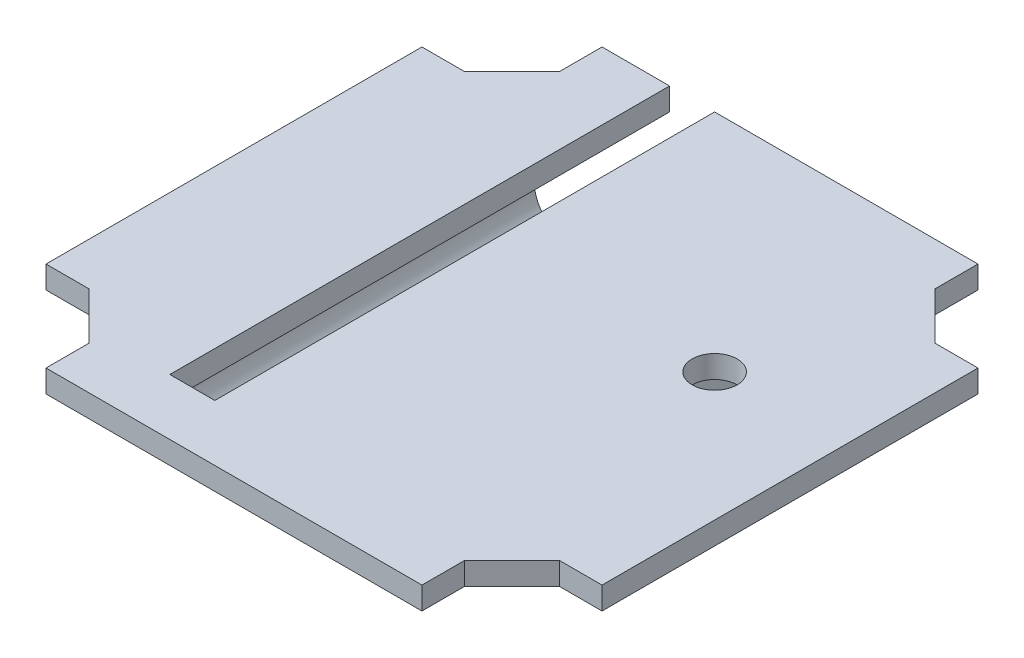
ISO-10303-21;
HEADER;
FILE_DESCRIPTION(('STEP AP214'),'2;1');
FILE_NAME('part.step','',(''),(''),'','','');
FILE_SCHEMA(('AUTOMOTIVE_DESIGN { 1 0 10303 214 1 1 1 1 }'));
ENDSEC;
DATA;
#1=APPLICATION_CONTEXT('core data for automotive mechanical design processes');
#2=APPLICATION_PROTOCOL_DEFINITION('international standard','automotive_design',2000,#1);
#3=PRODUCT_CONTEXT('',#1,'mechanical');
#4=PRODUCT('Part','Part','',(#3));
#5=PRODUCT_RELATED_PRODUCT_CATEGORY('part','',(#4));
#6=PRODUCT_DEFINITION_FORMATION('','',#4);
#7=PRODUCT_DEFINITION_CONTEXT('part definition',#1,'design');
#8=PRODUCT_DEFINITION('design','',#6,#7);
#9=PRODUCT_DEFINITION_SHAPE('','',#8);
#10=(LENGTH_UNIT() NAMED_UNIT(*) SI_UNIT(.MILLI.,.METRE.));
#11=(NAMED_UNIT(*) PLANE_ANGLE_UNIT() SI_UNIT($,.RADIAN.));
#12=(NAMED_UNIT(*) SI_UNIT($,.STERADIAN.) SOLID_ANGLE_UNIT());
#13=UNCERTAINTY_MEASURE_WITH_UNIT(LENGTH_MEASURE(1.E-05),#10,'distance_accuracy_value','');
#14=(GEOMETRIC_REPRESENTATION_CONTEXT(3) GLOBAL_UNCERTAINTY_ASSIGNED_CONTEXT((#13)) GLOBAL_UNIT_ASSIGNED_CONTEXT((#10,
#11,#12)) REPRESENTATION_CONTEXT('',''));
#15=CARTESIAN_POINT('',(0.,0.,0.));
#16=DIRECTION('',(0.,0.,1.));
#17=DIRECTION('',(1.,0.,0.));
#18=AXIS2_PLACEMENT_3D('',#15,#16,#17);
#19=CARTESIAN_POINT('',(0.,2.,-24.7));
#20=DIRECTION('',(0.,0.,-1.));
#21=DIRECTION('',(-1.,0.,0.));
#22=AXIS2_PLACEMENT_3D('',#19,#20,#21);
#23=PLANE('',#22);
#24=DIRECTION('',(0.,1.,0.));
#25=VECTOR('',#24,1.);
#26=CARTESIAN_POINT('',(-10.7,-6.,-24.7));
#27=LINE('',#26,#25);
#28=CARTESIAN_POINT('',(-10.7,0.,-24.7));
#29=VERTEX_POINT('',#28);
#30=CARTESIAN_POINT('',(-10.7,2.,-24.7));
#31=VERTEX_POINT('',#30);
#32=EDGE_CURVE('E262',#29,#31,#27,.T.);
#33=ORIENTED_EDGE('',*,*,#32,.F.);
#34=DIRECTION('',(1.,0.,0.));
#35=VECTOR('',#34,1.);
#36=CARTESIAN_POINT('',(0.,0.,-24.7));
#37=LINE('',#36,#35);
#38=CARTESIAN_POINT('',(-16.7,0.,-24.7));
#39=VERTEX_POINT('',#38);
#40=EDGE_CURVE('E428',#39,#29,#37,.T.);
#41=ORIENTED_EDGE('',*,*,#40,.F.);
#42=DIRECTION('',(0.,-1.,0.));
#43=VECTOR('',#42,1.);
#44=CARTESIAN_POINT('',(-16.7,2.,-24.7));
#45=LINE('',#44,#43);
#46=CARTESIAN_POINT('',(-16.7,2.,-24.7));
#47=VERTEX_POINT('',#46);
#48=EDGE_CURVE('E493',#47,#39,#45,.T.);
#49=ORIENTED_EDGE('',*,*,#48,.F.);
#50=DIRECTION('',(1.,0.,0.));
#51=VECTOR('',#50,1.);
#52=CARTESIAN_POINT('',(0.,2.,-24.7));
#53=LINE('',#52,#51);
#54=EDGE_CURVE('E375',#47,#31,#53,.T.);
#55=ORIENTED_EDGE('',*,*,#54,.T.);
#56=EDGE_LOOP('',(#33,#41,#49,#55));
#57=FACE_BOUND('',#56,.T.);
#58=ADVANCED_FACE('F43',(#57),#23,.T.);
#59=CARTESIAN_POINT('',(18.8,2.,18.8));
#60=DIRECTION('',(-0.707106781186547,0.,-0.707106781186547));
#61=DIRECTION('',(-0.707106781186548,0.,0.707106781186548));
#62=AXIS2_PLACEMENT_3D('',#59,#60,#61);
#63=PLANE('',#62);
#64=DIRECTION('',(0.707106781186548,0.,-0.707106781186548));
#65=VECTOR('',#64,1.);
#66=CARTESIAN_POINT('',(18.8,0.,18.8));
#67=LINE('',#66,#65);
#68=CARTESIAN_POINT('',(16.7,0.,20.9));
#69=VERTEX_POINT('',#68);
#70=CARTESIAN_POINT('',(20.9,0.,16.7));
#71=VERTEX_POINT('',#70);
#72=EDGE_CURVE('E342',#69,#71,#67,.T.);
#73=ORIENTED_EDGE('',*,*,#72,.T.);
#74=DIRECTION('',(0.,-1.,0.));
#75=VECTOR('',#74,1.);
#76=CARTESIAN_POINT('',(20.9,2.,16.7));
#77=LINE('',#76,#75);
#78=CARTESIAN_POINT('',(20.9,2.,16.7));
#79=VERTEX_POINT('',#78);
#80=EDGE_CURVE('E516',#79,#71,#77,.T.);
#81=ORIENTED_EDGE('',*,*,#80,.F.);
#82=DIRECTION('',(0.707106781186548,0.,-0.707106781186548));
#83=VECTOR('',#82,1.);
#84=CARTESIAN_POINT('',(18.8,2.,18.8));
#85=LINE('',#84,#83);
#86=CARTESIAN_POINT('',(16.7,2.,20.9));
#87=VERTEX_POINT('',#86);
#88=EDGE_CURVE('E355',#87,#79,#85,.T.);
#89=ORIENTED_EDGE('',*,*,#88,.F.);
#90=DIRECTION('',(0.,-1.,0.));
#91=VECTOR('',#90,1.);
#92=CARTESIAN_POINT('',(16.7,2.,20.9));
#93=LINE('',#92,#91);
#94=EDGE_CURVE('E407',#87,#69,#93,.T.);
#95=ORIENTED_EDGE('',*,*,#94,.T.);
#96=EDGE_LOOP('',(#73,#81,#89,#95));
#97=FACE_BOUND('',#96,.T.);
#98=ADVANCED_FACE('F614',(#97),#63,.F.);
#99=CARTESIAN_POINT('',(0.,2.,16.6999999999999));
#100=DIRECTION('',(0.,0.,-1.));
#101=DIRECTION('',(-1.,0.,0.));
#102=AXIS2_PLACEMENT_3D('',#99,#100,#101);
#103=PLANE('',#102);
#104=DIRECTION('',(1.,0.,0.));
#105=VECTOR('',#104,1.);
#106=CARTESIAN_POINT('',(0.,0.,16.6999999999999));
#107=LINE('',#106,#105);
#108=CARTESIAN_POINT('',(24.7,0.,16.7));
#109=VERTEX_POINT('',#108);
#110=EDGE_CURVE('E411',#71,#109,#107,.T.);
#111=ORIENTED_EDGE('',*,*,#110,.T.);
#112=DIRECTION('',(0.,-1.,0.));
#113=VECTOR('',#112,1.);
#114=CARTESIAN_POINT('',(24.7,2.,16.7));
#115=LINE('',#114,#113);
#116=CARTESIAN_POINT('',(24.7,2.,16.7));
#117=VERTEX_POINT('',#116);
#118=EDGE_CURVE('E512',#117,#109,#115,.T.);
#119=ORIENTED_EDGE('',*,*,#118,.F.);
#120=DIRECTION('',(1.,0.,0.));
#121=VECTOR('',#120,1.);
#122=CARTESIAN_POINT('',(0.,2.,16.6999999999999));
#123=LINE('',#122,#121);
#124=EDGE_CURVE('E359',#79,#117,#123,.T.);
#125=ORIENTED_EDGE('',*,*,#124,.F.);
#126=ORIENTED_EDGE('',*,*,#80,.T.);
#127=EDGE_LOOP('',(#111,#119,#125,#126));
#128=FACE_BOUND('',#127,.T.);
#129=ADVANCED_FACE('F611',(#128),#103,.F.);
#130=CARTESIAN_POINT('',(24.7,2.,0.));
#131=DIRECTION('',(-1.,0.,0.));
#132=DIRECTION('',(0.,0.,1.));
#133=AXIS2_PLACEMENT_3D('',#130,#131,#132);
#134=PLANE('',#133);
#135=DIRECTION('',(0.,0.,-1.));
#136=VECTOR('',#135,1.);
#137=CARTESIAN_POINT('',(24.7,0.,0.));
#138=LINE('',#137,#136);
#139=CARTESIAN_POINT('',(24.7,0.,-16.7));
#140=VERTEX_POINT('',#139);
#141=EDGE_CURVE('E414',#109,#140,#138,.T.);
#142=ORIENTED_EDGE('',*,*,#141,.T.);
#143=DIRECTION('',(0.,-1.,0.));
#144=VECTOR('',#143,1.);
#145=CARTESIAN_POINT('',(24.7,2.,-16.7));
#146=LINE('',#145,#144);
#147=CARTESIAN_POINT('',(24.7,2.,-16.7));
#148=VERTEX_POINT('',#147);
#149=EDGE_CURVE('E508',#148,#140,#146,.T.);
#150=ORIENTED_EDGE('',*,*,#149,.F.);
#151=DIRECTION('',(0.,0.,-1.));
#152=VECTOR('',#151,1.);
#153=CARTESIAN_POINT('',(24.7,2.,0.));
#154=LINE('',#153,#152);
#155=EDGE_CURVE('E363',#117,#148,#154,.T.);
#156=ORIENTED_EDGE('',*,*,#155,.F.);
#157=ORIENTED_EDGE('',*,*,#118,.T.);
#158=EDGE_LOOP('',(#142,#150,#156,#157));
#159=FACE_BOUND('',#158,.T.);
#160=ADVANCED_FACE('F605',(#159),#134,.F.);
#161=CARTESIAN_POINT('',(0.,2.,-16.7));
#162=DIRECTION('',(0.,0.,1.));
#163=DIRECTION('',(1.,0.,0.));
#164=AXIS2_PLACEMENT_3D('',#161,#162,#163);
#165=PLANE('',#164);
#166=DIRECTION('',(-1.,0.,0.));
#167=VECTOR('',#166,1.);
#168=CARTESIAN_POINT('',(0.,0.,-16.7));
#169=LINE('',#168,#167);
#170=CARTESIAN_POINT('',(20.9,0.,-16.7));
#171=VERTEX_POINT('',#170);
#172=EDGE_CURVE('E417',#140,#171,#169,.T.);
#173=ORIENTED_EDGE('',*,*,#172,.T.);
#174=DIRECTION('',(0.,-1.,0.));
#175=VECTOR('',#174,1.);
#176=CARTESIAN_POINT('',(20.9,2.,-16.7));
#177=LINE('',#176,#175);
#178=CARTESIAN_POINT('',(20.9,2.,-16.7));
#179=VERTEX_POINT('',#178);
#180=EDGE_CURVE('E504',#179,#171,#177,.T.);
#181=ORIENTED_EDGE('',*,*,#180,.F.);
#182=DIRECTION('',(-1.,0.,0.));
#183=VECTOR('',#182,1.);
#184=CARTESIAN_POINT('',(0.,2.,-16.7));
#185=LINE('',#184,#183);
#186=EDGE_CURVE('E366',#148,#179,#185,.T.);
#187=ORIENTED_EDGE('',*,*,#186,.F.);
#188=ORIENTED_EDGE('',*,*,#149,.T.);
#189=EDGE_LOOP('',(#173,#181,#187,#188));
#190=FACE_BOUND('',#189,.T.);
#191=ADVANCED_FACE('F601',(#190),#165,.F.);
#192=CARTESIAN_POINT('',(18.8,2.,-18.8));
#193=DIRECTION('',(-0.707106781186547,0.,0.707106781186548));
#194=DIRECTION('',(0.707106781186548,0.,0.707106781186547));
#195=AXIS2_PLACEMENT_3D('',#192,#193,#194);
#196=PLANE('',#195);
#197=DIRECTION('',(-0.707106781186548,0.,-0.707106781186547));
#198=VECTOR('',#197,1.);
#199=CARTESIAN_POINT('',(18.8,0.,-18.8));
#200=LINE('',#199,#198);
#201=CARTESIAN_POINT('',(16.7,0.,-20.9));
#202=VERTEX_POINT('',#201);
#203=EDGE_CURVE('E420',#171,#202,#200,.T.);
#204=ORIENTED_EDGE('',*,*,#203,.T.);
#205=DIRECTION('',(0.,-1.,0.));
#206=VECTOR('',#205,1.);
#207=CARTESIAN_POINT('',(16.7,2.,-20.9));
#208=LINE('',#207,#206);
#209=CARTESIAN_POINT('',(16.7,2.,-20.9));
#210=VERTEX_POINT('',#209);
#211=EDGE_CURVE('E500',#210,#202,#208,.T.);
#212=ORIENTED_EDGE('',*,*,#211,.F.);
#213=DIRECTION('',(-0.707106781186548,0.,-0.707106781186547));
#214=VECTOR('',#213,1.);
#215=CARTESIAN_POINT('',(18.8,2.,-18.8));
#216=LINE('',#215,#214);
#217=EDGE_CURVE('E369',#179,#210,#216,.T.);
#218=ORIENTED_EDGE('',*,*,#217,.F.);
#219=ORIENTED_EDGE('',*,*,#180,.T.);
#220=EDGE_LOOP('',(#204,#212,#218,#219));
#221=FACE_BOUND('',#220,.T.);
#222=ADVANCED_FACE('F597',(#221),#196,.F.);
#223=CARTESIAN_POINT('',(16.7,2.,0.));
#224=DIRECTION('',(-1.,0.,0.));
#225=DIRECTION('',(0.,0.,1.));
#226=AXIS2_PLACEMENT_3D('',#223,#224,#225);
#227=PLANE('',#226);
#228=DIRECTION('',(0.,0.,-1.));
#229=VECTOR('',#228,1.);
#230=CARTESIAN_POINT('',(16.7,0.,0.));
#231=LINE('',#230,#229);
#232=CARTESIAN_POINT('',(16.7,0.,-24.7));
#233=VERTEX_POINT('',#232);
#234=EDGE_CURVE('E423',#202,#233,#231,.T.);
#235=ORIENTED_EDGE('',*,*,#234,.T.);
#236=DIRECTION('',(0.,-1.,0.));
#237=VECTOR('',#236,1.);
#238=CARTESIAN_POINT('',(16.7,2.,-24.7));
#239=LINE('',#238,#237);
#240=CARTESIAN_POINT('',(16.7,2.,-24.7));
#241=VERTEX_POINT('',#240);
#242=EDGE_CURVE('E496',#241,#233,#239,.T.);
#243=ORIENTED_EDGE('',*,*,#242,.F.);
#244=DIRECTION('',(0.,0.,-1.));
#245=VECTOR('',#244,1.);
#246=CARTESIAN_POINT('',(16.7,2.,0.));
#247=LINE('',#246,#245);
#248=EDGE_CURVE('E372',#210,#241,#247,.T.);
#249=ORIENTED_EDGE('',*,*,#248,.F.);
#250=ORIENTED_EDGE('',*,*,#211,.T.);
#251=EDGE_LOOP('',(#235,#243,#249,#250));
#252=FACE_BOUND('',#251,.T.);
#253=ADVANCED_FACE('F592',(#252),#227,.F.);
#254=DIRECTION('',(0.,1.,0.));
#255=VECTOR('',#254,1.);
#256=CARTESIAN_POINT('',(-6.69999999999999,-6.,-24.7));
#257=LINE('',#256,#255);
#258=CARTESIAN_POINT('',(-6.69999999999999,0.,-24.7));
#259=VERTEX_POINT('',#258);
#260=CARTESIAN_POINT('',(-6.69999999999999,2.,-24.7));
#261=VERTEX_POINT('',#260);
#262=EDGE_CURVE('E270',#259,#261,#257,.T.);
#263=ORIENTED_EDGE('',*,*,#262,.T.);
#264=EDGE_CURVE('E275',#261,#241,#53,.T.);
#265=ORIENTED_EDGE('',*,*,#264,.T.);
#266=ORIENTED_EDGE('',*,*,#242,.T.);
#267=EDGE_CURVE('E427',#259,#233,#37,.T.);
#268=ORIENTED_EDGE('',*,*,#267,.F.);
#269=EDGE_LOOP('',(#263,#265,#266,#268));
#270=FACE_BOUND('',#269,.T.);
#271=ADVANCED_FACE('F584',(#270),#23,.T.);
#272=CARTESIAN_POINT('',(-16.7,2.,0.));
#273=DIRECTION('',(1.,0.,0.));
#274=DIRECTION('',(0.,0.,-1.));
#275=AXIS2_PLACEMENT_3D('',#272,#273,#274);
#276=PLANE('',#275);
#277=DIRECTION('',(0.,0.,1.));
#278=VECTOR('',#277,1.);
#279=CARTESIAN_POINT('',(-16.7,0.,0.));
#280=LINE('',#279,#278);
#281=CARTESIAN_POINT('',(-16.7,0.,-20.9));
#282=VERTEX_POINT('',#281);
#283=EDGE_CURVE('E432',#39,#282,#280,.T.);
#284=ORIENTED_EDGE('',*,*,#283,.T.);
#285=DIRECTION('',(0.,-1.,0.));
#286=VECTOR('',#285,1.);
#287=CARTESIAN_POINT('',(-16.7,2.,-20.9));
#288=LINE('',#287,#286);
#289=CARTESIAN_POINT('',(-16.7,2.,-20.9));
#290=VERTEX_POINT('',#289);
#291=EDGE_CURVE('E489',#290,#282,#288,.T.);
#292=ORIENTED_EDGE('',*,*,#291,.F.);
#293=DIRECTION('',(0.,0.,1.));
#294=VECTOR('',#293,1.);
#295=CARTESIAN_POINT('',(-16.7,2.,0.));
#296=LINE('',#295,#294);
#297=EDGE_CURVE('E379',#47,#290,#296,.T.);
#298=ORIENTED_EDGE('',*,*,#297,.F.);
#299=ORIENTED_EDGE('',*,*,#48,.T.);
#300=EDGE_LOOP('',(#284,#292,#298,#299));
#301=FACE_BOUND('',#300,.T.);
#302=ADVANCED_FACE('F657',(#301),#276,.F.);
#303=CARTESIAN_POINT('',(-18.8,2.,-18.8));
#304=DIRECTION('',(0.707106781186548,0.,0.707106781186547));
#305=DIRECTION('',(0.707106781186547,0.,-0.707106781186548));
#306=AXIS2_PLACEMENT_3D('',#303,#304,#305);
#307=PLANE('',#306);
#308=DIRECTION('',(-0.707106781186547,0.,0.707106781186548));
#309=VECTOR('',#308,1.);
#310=CARTESIAN_POINT('',(-18.8,0.,-18.8));
#311=LINE('',#310,#309);
#312=CARTESIAN_POINT('',(-20.9,0.,-16.7));
#313=VERTEX_POINT('',#312);
#314=EDGE_CURVE('E435',#282,#313,#311,.T.);
#315=ORIENTED_EDGE('',*,*,#314,.T.);
#316=DIRECTION('',(0.,-1.,0.));
#317=VECTOR('',#316,1.);
#318=CARTESIAN_POINT('',(-20.9,2.,-16.7));
#319=LINE('',#318,#317);
#320=CARTESIAN_POINT('',(-20.9,2.,-16.7));
#321=VERTEX_POINT('',#320);
#322=EDGE_CURVE('E485',#321,#313,#319,.T.);
#323=ORIENTED_EDGE('',*,*,#322,.F.);
#324=DIRECTION('',(-0.707106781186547,0.,0.707106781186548));
#325=VECTOR('',#324,1.);
#326=CARTESIAN_POINT('',(-18.8,2.,-18.8));
#327=LINE('',#326,#325);
#328=EDGE_CURVE('E382',#290,#321,#327,.T.);
#329=ORIENTED_EDGE('',*,*,#328,.F.);
#330=ORIENTED_EDGE('',*,*,#291,.T.);
#331=EDGE_LOOP('',(#315,#323,#329,#330));
#332=FACE_BOUND('',#331,.T.);
#333=ADVANCED_FACE('F652',(#332),#307,.F.);
#334=CARTESIAN_POINT('',(0.,2.,-16.7));
#335=DIRECTION('',(0.,0.,1.));
#336=DIRECTION('',(1.,0.,0.));
#337=AXIS2_PLACEMENT_3D('',#334,#335,#336);
#338=PLANE('',#337);
#339=DIRECTION('',(-1.,0.,0.));
#340=VECTOR('',#339,1.);
#341=CARTESIAN_POINT('',(0.,0.,-16.7));
#342=LINE('',#341,#340);
#343=CARTESIAN_POINT('',(-24.7,0.,-16.7));
#344=VERTEX_POINT('',#343);
#345=EDGE_CURVE('E438',#313,#344,#342,.T.);
#346=ORIENTED_EDGE('',*,*,#345,.T.);
#347=DIRECTION('',(0.,-1.,0.));
#348=VECTOR('',#347,1.);
#349=CARTESIAN_POINT('',(-24.7,2.,-16.7));
#350=LINE('',#349,#348);
#351=CARTESIAN_POINT('',(-24.7,2.,-16.7));
#352=VERTEX_POINT('',#351);
#353=EDGE_CURVE('E482',#352,#344,#350,.T.);
#354=ORIENTED_EDGE('',*,*,#353,.F.);
#355=DIRECTION('',(-1.,0.,0.));
#356=VECTOR('',#355,1.);
#357=CARTESIAN_POINT('',(0.,2.,-16.7));
#358=LINE('',#357,#356);
#359=EDGE_CURVE('E385',#321,#352,#358,.T.);
#360=ORIENTED_EDGE('',*,*,#359,.F.);
#361=ORIENTED_EDGE('',*,*,#322,.T.);
#362=EDGE_LOOP('',(#346,#354,#360,#361));
#363=FACE_BOUND('',#362,.T.);
#364=ADVANCED_FACE('F646',(#363),#338,.F.);
#365=CARTESIAN_POINT('',(-24.7,2.,0.));
#366=DIRECTION('',(-1.,0.,0.));
#367=DIRECTION('',(0.,0.,1.));
#368=AXIS2_PLACEMENT_3D('',#365,#366,#367);
#369=PLANE('',#368);
#370=DIRECTION('',(0.,0.,-1.));
#371=VECTOR('',#370,1.);
#372=CARTESIAN_POINT('',(-24.7,0.,0.));
#373=LINE('',#372,#371);
#374=CARTESIAN_POINT('',(-24.7,0.,16.7));
#375=VERTEX_POINT('',#374);
#376=EDGE_CURVE('E442',#375,#344,#373,.T.);
#377=ORIENTED_EDGE('',*,*,#376,.F.);
#378=DIRECTION('',(0.,-1.,0.));
#379=VECTOR('',#378,1.);
#380=CARTESIAN_POINT('',(-24.7,2.,16.7));
#381=LINE('',#380,#379);
#382=CARTESIAN_POINT('',(-24.7,2.,16.7));
#383=VERTEX_POINT('',#382);
#384=EDGE_CURVE('E479',#383,#375,#381,.T.);
#385=ORIENTED_EDGE('',*,*,#384,.F.);
#386=DIRECTION('',(0.,0.,-1.));
#387=VECTOR('',#386,1.);
#388=CARTESIAN_POINT('',(-24.7,2.,0.));
#389=LINE('',#388,#387);
#390=EDGE_CURVE('E388',#383,#352,#389,.T.);
#391=ORIENTED_EDGE('',*,*,#390,.T.);
#392=ORIENTED_EDGE('',*,*,#353,.T.);
#393=EDGE_LOOP('',(#377,#385,#391,#392));
#394=FACE_BOUND('',#393,.T.);
#395=ADVANCED_FACE('F640',(#394),#369,.T.);
#396=CARTESIAN_POINT('',(0.,2.,16.7));
#397=DIRECTION('',(0.,0.,-1.));
#398=DIRECTION('',(-1.,0.,0.));
#399=AXIS2_PLACEMENT_3D('',#396,#397,#398);
#400=PLANE('',#399);
#401=DIRECTION('',(1.,0.,0.));
#402=VECTOR('',#401,1.);
#403=CARTESIAN_POINT('',(0.,0.,16.7));
#404=LINE('',#403,#402);
#405=CARTESIAN_POINT('',(-20.9,0.,16.7));
#406=VERTEX_POINT('',#405);
#407=EDGE_CURVE('E446',#375,#406,#404,.T.);
#408=ORIENTED_EDGE('',*,*,#407,.T.);
#409=DIRECTION('',(0.,-1.,0.));
#410=VECTOR('',#409,1.);
#411=CARTESIAN_POINT('',(-20.9,2.,16.7));
#412=LINE('',#411,#410);
#413=CARTESIAN_POINT('',(-20.9,2.,16.7));
#414=VERTEX_POINT('',#413);
#415=EDGE_CURVE('E475',#414,#406,#412,.T.);
#416=ORIENTED_EDGE('',*,*,#415,.F.);
#417=DIRECTION('',(1.,0.,0.));
#418=VECTOR('',#417,1.);
#419=CARTESIAN_POINT('',(0.,2.,16.7));
#420=LINE('',#419,#418);
#421=EDGE_CURVE('E392',#383,#414,#420,.T.);
#422=ORIENTED_EDGE('',*,*,#421,.F.);
#423=ORIENTED_EDGE('',*,*,#384,.T.);
#424=EDGE_LOOP('',(#408,#416,#422,#423));
#425=FACE_BOUND('',#424,.T.);
#426=ADVANCED_FACE('F799',(#425),#400,.F.);
#427=CARTESIAN_POINT('',(-18.8,2.,18.8));
#428=DIRECTION('',(0.707106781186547,0.,-0.707106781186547));
#429=DIRECTION('',(-0.707106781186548,0.,-0.707106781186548));
#430=AXIS2_PLACEMENT_3D('',#427,#428,#429);
#431=PLANE('',#430);
#432=DIRECTION('',(0.707106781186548,0.,0.707106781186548));
#433=VECTOR('',#432,1.);
#434=CARTESIAN_POINT('',(-18.8,0.,18.8));
#435=LINE('',#434,#433);
#436=CARTESIAN_POINT('',(-16.7,0.,20.9));
#437=VERTEX_POINT('',#436);
#438=EDGE_CURVE('E449',#406,#437,#435,.T.);
#439=ORIENTED_EDGE('',*,*,#438,.T.);
#440=DIRECTION('',(0.,-1.,0.));
#441=VECTOR('',#440,1.);
#442=CARTESIAN_POINT('',(-16.7,2.,20.9));
#443=LINE('',#442,#441);
#444=CARTESIAN_POINT('',(-16.7,2.,20.9));
#445=VERTEX_POINT('',#444);
#446=EDGE_CURVE('E471',#445,#437,#443,.T.);
#447=ORIENTED_EDGE('',*,*,#446,.F.);
#448=DIRECTION('',(0.707106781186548,0.,0.707106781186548));
#449=VECTOR('',#448,1.);
#450=CARTESIAN_POINT('',(-18.8,2.,18.8));
#451=LINE('',#450,#449);
#452=EDGE_CURVE('E395',#414,#445,#451,.T.);
#453=ORIENTED_EDGE('',*,*,#452,.F.);
#454=ORIENTED_EDGE('',*,*,#415,.T.);
#455=EDGE_LOOP('',(#439,#447,#453,#454));
#456=FACE_BOUND('',#455,.T.);
#457=ADVANCED_FACE('F633',(#456),#431,.F.);
#458=CARTESIAN_POINT('',(-16.7,2.,0.));
#459=DIRECTION('',(1.,0.,0.));
#460=DIRECTION('',(0.,0.,-1.));
#461=AXIS2_PLACEMENT_3D('',#458,#459,#460);
#462=PLANE('',#461);
#463=DIRECTION('',(0.,0.,1.));
#464=VECTOR('',#463,1.);
#465=CARTESIAN_POINT('',(-16.7,0.,0.));
#466=LINE('',#465,#464);
#467=CARTESIAN_POINT('',(-16.7,0.,24.7));
#468=VERTEX_POINT('',#467);
#469=EDGE_CURVE('E452',#437,#468,#466,.T.);
#470=ORIENTED_EDGE('',*,*,#469,.T.);
#471=DIRECTION('',(0.,-1.,0.));
#472=VECTOR('',#471,1.);
#473=CARTESIAN_POINT('',(-16.7,2.,24.7));
#474=LINE('',#473,#472);
#475=CARTESIAN_POINT('',(-16.7,2.,24.7));
#476=VERTEX_POINT('',#475);
#477=EDGE_CURVE('E467',#476,#468,#474,.T.);
#478=ORIENTED_EDGE('',*,*,#477,.F.);
#479=DIRECTION('',(0.,0.,1.));
#480=VECTOR('',#479,1.);
#481=CARTESIAN_POINT('',(-16.7,2.,0.));
#482=LINE('',#481,#480);
#483=EDGE_CURVE('E398',#445,#476,#482,.T.);
#484=ORIENTED_EDGE('',*,*,#483,.F.);
#485=ORIENTED_EDGE('',*,*,#446,.T.);
#486=EDGE_LOOP('',(#470,#478,#484,#485));
#487=FACE_BOUND('',#486,.T.);
#488=ADVANCED_FACE('F629',(#487),#462,.F.);
#489=CARTESIAN_POINT('',(0.,2.,24.7));
#490=DIRECTION('',(0.,0.,-1.));
#491=DIRECTION('',(-1.,0.,0.));
#492=AXIS2_PLACEMENT_3D('',#489,#490,#491);
#493=PLANE('',#492);
#494=DIRECTION('',(1.,0.,0.));
#495=VECTOR('',#494,1.);
#496=CARTESIAN_POINT('',(0.,0.,24.7));
#497=LINE('',#496,#495);
#498=CARTESIAN_POINT('',(16.7,0.,24.7));
#499=VERTEX_POINT('',#498);
#500=EDGE_CURVE('E455',#468,#499,#497,.T.);
#501=ORIENTED_EDGE('',*,*,#500,.T.);
#502=DIRECTION('',(0.,-1.,0.));
#503=VECTOR('',#502,1.);
#504=CARTESIAN_POINT('',(16.7,2.,24.7));
#505=LINE('',#504,#503);
#506=CARTESIAN_POINT('',(16.7,2.,24.7));
#507=VERTEX_POINT('',#506);
#508=EDGE_CURVE('E463',#507,#499,#505,.T.);
#509=ORIENTED_EDGE('',*,*,#508,.F.);
#510=DIRECTION('',(1.,0.,0.));
#511=VECTOR('',#510,1.);
#512=CARTESIAN_POINT('',(0.,2.,24.7));
#513=LINE('',#512,#511);
#514=EDGE_CURVE('E401',#476,#507,#513,.T.);
#515=ORIENTED_EDGE('',*,*,#514,.F.);
#516=ORIENTED_EDGE('',*,*,#477,.T.);
#517=EDGE_LOOP('',(#501,#509,#515,#516));
#518=FACE_BOUND('',#517,.T.);
#519=ADVANCED_FACE('F624',(#518),#493,.F.);
#520=CARTESIAN_POINT('',(16.7,2.,0.));
#521=DIRECTION('',(-1.,0.,0.));
#522=DIRECTION('',(0.,0.,1.));
#523=AXIS2_PLACEMENT_3D('',#520,#521,#522);
#524=PLANE('',#523);
#525=DIRECTION('',(0.,0.,-1.));
#526=VECTOR('',#525,1.);
#527=CARTESIAN_POINT('',(16.7,0.,0.));
#528=LINE('',#527,#526);
#529=EDGE_CURVE('E360',#499,#69,#528,.T.);
#530=ORIENTED_EDGE('',*,*,#529,.T.);
#531=ORIENTED_EDGE('',*,*,#94,.F.);
#532=DIRECTION('',(0.,0.,-1.));
#533=VECTOR('',#532,1.);
#534=CARTESIAN_POINT('',(16.7,2.,0.));
#535=LINE('',#534,#533);
#536=EDGE_CURVE('E404',#507,#87,#535,.T.);
#537=ORIENTED_EDGE('',*,*,#536,.F.);
#538=ORIENTED_EDGE('',*,*,#508,.T.);
#539=EDGE_LOOP('',(#530,#531,#537,#538));
#540=FACE_BOUND('',#539,.T.);
#541=ADVANCED_FACE('F618',(#540),#524,.F.);
#542=CARTESIAN_POINT('',(0.,2.,0.));
#543=DIRECTION('',(0.,1.,0.));
#544=DIRECTION('',(0.,0.,1.));
#545=AXIS2_PLACEMENT_3D('',#542,#543,#544);
#546=PLANE('',#545);
#547=CARTESIAN_POINT('',(13.3,2.,-4.7));
#548=DIRECTION('',(0.,1.,0.));
#549=DIRECTION('',(0.,0.,1.));
#550=AXIS2_PLACEMENT_3D('',#547,#548,#549);
#551=CIRCLE('',#550,2.);
#552=CARTESIAN_POINT('',(13.3,2.,-2.69999999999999));
#553=VERTEX_POINT('',#552);
#554=EDGE_CURVE('E664',#553,#553,#551,.T.);
#555=ORIENTED_EDGE('',*,*,#554,.F.);
#556=EDGE_LOOP('',(#555));
#557=FACE_BOUND('',#556,.T.);
#558=DIRECTION('',(0.,0.,1.));
#559=VECTOR('',#558,1.);
#560=CARTESIAN_POINT('',(-10.7,2.,0.));
#561=LINE('',#560,#559);
#562=CARTESIAN_POINT('',(-10.7,2.,19.7));
#563=VERTEX_POINT('',#562);
#564=EDGE_CURVE('E277',#31,#563,#561,.T.);
#565=ORIENTED_EDGE('',*,*,#564,.F.);
#566=ORIENTED_EDGE('',*,*,#54,.F.);
#567=ORIENTED_EDGE('',*,*,#297,.T.);
#568=ORIENTED_EDGE('',*,*,#328,.T.);
#569=ORIENTED_EDGE('',*,*,#359,.T.);
#570=ORIENTED_EDGE('',*,*,#390,.F.);
#571=ORIENTED_EDGE('',*,*,#421,.T.);
#572=ORIENTED_EDGE('',*,*,#452,.T.);
#573=ORIENTED_EDGE('',*,*,#483,.T.);
#574=ORIENTED_EDGE('',*,*,#514,.T.);
#575=ORIENTED_EDGE('',*,*,#536,.T.);
#576=ORIENTED_EDGE('',*,*,#88,.T.);
#577=ORIENTED_EDGE('',*,*,#124,.T.);
#578=ORIENTED_EDGE('',*,*,#155,.T.);
#579=ORIENTED_EDGE('',*,*,#186,.T.);
#580=ORIENTED_EDGE('',*,*,#217,.T.);
#581=ORIENTED_EDGE('',*,*,#248,.T.);
#582=ORIENTED_EDGE('',*,*,#264,.F.);
#583=DIRECTION('',(0.,0.,-1.));
#584=VECTOR('',#583,1.);
#585=CARTESIAN_POINT('',(-6.69999999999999,2.,0.));
#586=LINE('',#585,#584);
#587=CARTESIAN_POINT('',(-6.69999999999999,2.,19.7));
#588=VERTEX_POINT('',#587);
#589=EDGE_CURVE('E261',#588,#261,#586,.T.);
#590=ORIENTED_EDGE('',*,*,#589,.F.);
#591=DIRECTION('',(1.,0.,0.));
#592=VECTOR('',#591,1.);
#593=CARTESIAN_POINT('',(0.,2.,19.7));
#594=LINE('',#593,#592);
#595=EDGE_CURVE('E253',#563,#588,#594,.T.);
#596=ORIENTED_EDGE('',*,*,#595,.F.);
#597=EDGE_LOOP('',(#565,#566,#567,#568,#569,#570,#571,#572,#573,#574,#575,#576,#577,#578,#579,
#580,#581,#582,#590,#596));
#598=FACE_BOUND('',#597,.T.);
#599=ADVANCED_FACE('F273',(#557,#598),#546,.T.);
#600=CARTESIAN_POINT('',(0.,0.,0.));
#601=DIRECTION('',(0.,1.,0.));
#602=DIRECTION('',(0.,0.,1.));
#603=AXIS2_PLACEMENT_3D('',#600,#601,#602);
#604=PLANE('',#603);
#605=CARTESIAN_POINT('',(13.3,0.,-4.7));
#606=DIRECTION('',(0.,1.,0.));
#607=DIRECTION('',(0.,0.,1.));
#608=AXIS2_PLACEMENT_3D('',#605,#606,#607);
#609=CIRCLE('',#608,2.);
#610=CARTESIAN_POINT('',(13.3,0.,-2.69999999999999));
#611=VERTEX_POINT('',#610);
#612=EDGE_CURVE('E47',#611,#611,#609,.T.);
#613=ORIENTED_EDGE('',*,*,#612,.T.);
#614=EDGE_LOOP('',(#613));
#615=FACE_BOUND('',#614,.T.);
#616=ORIENTED_EDGE('',*,*,#40,.T.);
#617=DIRECTION('',(0.,0.,1.));
#618=VECTOR('',#617,1.);
#619=CARTESIAN_POINT('',(-10.7,0.,0.));
#620=LINE('',#619,#618);
#621=CARTESIAN_POINT('',(-10.7,0.,19.7));
#622=VERTEX_POINT('',#621);
#623=EDGE_CURVE('E12',#29,#622,#620,.T.);
#624=ORIENTED_EDGE('',*,*,#623,.T.);
#625=DIRECTION('',(1.,0.,0.));
#626=VECTOR('',#625,1.);
#627=CARTESIAN_POINT('',(0.,0.,19.7));
#628=LINE('',#627,#626);
#629=CARTESIAN_POINT('',(-6.69999999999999,0.,19.7));
#630=VERTEX_POINT('',#629);
#631=EDGE_CURVE('E574',#622,#630,#628,.T.);
#632=ORIENTED_EDGE('',*,*,#631,.T.);
#633=DIRECTION('',(0.,0.,-1.));
#634=VECTOR('',#633,1.);
#635=CARTESIAN_POINT('',(-6.69999999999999,0.,0.));
#636=LINE('',#635,#634);
#637=EDGE_CURVE('E53',#630,#259,#636,.T.);
#638=ORIENTED_EDGE('',*,*,#637,.T.);
#639=ORIENTED_EDGE('',*,*,#267,.T.);
#640=ORIENTED_EDGE('',*,*,#234,.F.);
#641=ORIENTED_EDGE('',*,*,#203,.F.);
#642=ORIENTED_EDGE('',*,*,#172,.F.);
#643=ORIENTED_EDGE('',*,*,#141,.F.);
#644=ORIENTED_EDGE('',*,*,#110,.F.);
#645=ORIENTED_EDGE('',*,*,#72,.F.);
#646=ORIENTED_EDGE('',*,*,#529,.F.);
#647=ORIENTED_EDGE('',*,*,#500,.F.);
#648=ORIENTED_EDGE('',*,*,#469,.F.);
#649=ORIENTED_EDGE('',*,*,#438,.F.);
#650=ORIENTED_EDGE('',*,*,#407,.F.);
#651=ORIENTED_EDGE('',*,*,#376,.T.);
#652=ORIENTED_EDGE('',*,*,#345,.F.);
#653=ORIENTED_EDGE('',*,*,#314,.F.);
#654=ORIENTED_EDGE('',*,*,#283,.F.);
#655=EDGE_LOOP('',(#616,#624,#632,#638,#639,#640,#641,#642,#643,#644,#645,#646,#647,#648,#649,
#650,#651,#652,#653,#654));
#656=FACE_BOUND('',#655,.T.);
#657=DIRECTION('',(1.,0.,0.));
#658=VECTOR('',#657,1.);
#659=CARTESIAN_POINT('',(0.,0.,16.2));
#660=LINE('',#659,#658);
#661=CARTESIAN_POINT('',(4.80000000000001,0.,16.2));
#662=VERTEX_POINT('',#661);
#663=CARTESIAN_POINT('',(10.3,0.,16.2));
#664=VERTEX_POINT('',#663);
#665=EDGE_CURVE('E284',#662,#664,#660,.T.);
#666=ORIENTED_EDGE('',*,*,#665,.T.);
#667=DIRECTION('',(0.,0.,1.));
#668=VECTOR('',#667,1.);
#669=CARTESIAN_POINT('',(10.3,0.,-16.2));
#670=LINE('',#669,#668);
#671=CARTESIAN_POINT('',(10.3,0.,-16.2));
#672=VERTEX_POINT('',#671);
#673=EDGE_CURVE('E554',#664,#672,#670,.F.);
#674=ORIENTED_EDGE('',*,*,#673,.T.);
#675=DIRECTION('',(1.,0.,0.));
#676=VECTOR('',#675,1.);
#677=CARTESIAN_POINT('',(0.,0.,-16.2));
#678=LINE('',#677,#676);
#679=CARTESIAN_POINT('',(4.80000000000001,0.,-16.2));
#680=VERTEX_POINT('',#679);
#681=EDGE_CURVE('E303',#680,#672,#678,.T.);
#682=ORIENTED_EDGE('',*,*,#681,.F.);
#683=DIRECTION('',(0.,0.,1.));
#684=VECTOR('',#683,1.);
#685=CARTESIAN_POINT('',(4.80000000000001,0.,-32.2));
#686=LINE('',#685,#684);
#687=EDGE_CURVE('E288',#680,#662,#686,.T.);
#688=ORIENTED_EDGE('',*,*,#687,.T.);
#689=EDGE_LOOP('',(#666,#674,#682,#688));
#690=FACE_BOUND('',#689,.T.);
#691=DIRECTION('',(0.,0.,1.));
#692=VECTOR('',#691,1.);
#693=CARTESIAN_POINT('',(-16.7,0.,0.));
#694=LINE('',#693,#692);
#695=CARTESIAN_POINT('',(-16.7,0.,-16.2));
#696=VERTEX_POINT('',#695);
#697=CARTESIAN_POINT('',(-16.7,0.,16.2));
#698=VERTEX_POINT('',#697);
#699=EDGE_CURVE('E550',#696,#698,#694,.T.);
#700=ORIENTED_EDGE('',*,*,#699,.T.);
#701=DIRECTION('',(1.,0.,0.));
#702=VECTOR('',#701,1.);
#703=CARTESIAN_POINT('',(0.,0.,16.2));
#704=LINE('',#703,#702);
#705=CARTESIAN_POINT('',(-11.2,0.,16.2));
#706=VERTEX_POINT('',#705);
#707=EDGE_CURVE('E328',#698,#706,#704,.T.);
#708=ORIENTED_EDGE('',*,*,#707,.T.);
#709=DIRECTION('',(0.,0.,1.));
#710=VECTOR('',#709,1.);
#711=CARTESIAN_POINT('',(-11.2,0.,-32.2));
#712=LINE('',#711,#710);
#713=CARTESIAN_POINT('',(-11.2,0.,-16.2));
#714=VERTEX_POINT('',#713);
#715=EDGE_CURVE('E302',#714,#706,#712,.T.);
#716=ORIENTED_EDGE('',*,*,#715,.F.);
#717=DIRECTION('',(1.,0.,0.));
#718=VECTOR('',#717,1.);
#719=CARTESIAN_POINT('',(0.,0.,-16.2));
#720=LINE('',#719,#718);
#721=EDGE_CURVE('E327',#696,#714,#720,.T.);
#722=ORIENTED_EDGE('',*,*,#721,.F.);
#723=EDGE_LOOP('',(#700,#708,#716,#722));
#724=FACE_BOUND('',#723,.T.);
#725=ADVANCED_FACE('F580',(#615,#656,#690,#724),#604,.F.);
#726=CARTESIAN_POINT('',(-11.2,-3.,-32.2));
#727=DIRECTION('',(0.,0.,1.));
#728=DIRECTION('',(1.,0.,0.));
#729=AXIS2_PLACEMENT_3D('',#726,#727,#728);
#730=CYLINDRICAL_SURFACE('',#729,3.);
#731=CARTESIAN_POINT('',(-11.2,-3.,16.2));
#732=DIRECTION('',(0.,0.,1.));
#733=DIRECTION('',(1.,0.,0.));
#734=AXIS2_PLACEMENT_3D('',#731,#732,#733);
#735=CIRCLE('',#734,3.);
#736=CARTESIAN_POINT('',(-12.6523687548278,-5.625,16.2));
#737=VERTEX_POINT('',#736);
#738=EDGE_CURVE('E323',#706,#737,#735,.T.);
#739=ORIENTED_EDGE('',*,*,#738,.T.);
#740=DIRECTION('',(0.,0.,1.));
#741=VECTOR('',#740,1.);
#742=CARTESIAN_POINT('',(-12.6523687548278,-5.625,-32.2));
#743=LINE('',#742,#741);
#744=CARTESIAN_POINT('',(-12.6523687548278,-5.625,-16.2));
#745=VERTEX_POINT('',#744);
#746=EDGE_CURVE('E540',#737,#745,#743,.F.);
#747=ORIENTED_EDGE('',*,*,#746,.T.);
#748=CARTESIAN_POINT('',(-11.2,-3.,-16.2));
#749=DIRECTION('',(0.,0.,-1.));
#750=DIRECTION('',(-1.,0.,0.));
#751=AXIS2_PLACEMENT_3D('',#748,#749,#750);
#752=CIRCLE('',#751,3.);
#753=EDGE_CURVE('E343',#714,#745,#752,.F.);
#754=ORIENTED_EDGE('',*,*,#753,.F.);
#755=ORIENTED_EDGE('',*,*,#715,.T.);
#756=EDGE_LOOP('',(#739,#747,#754,#755));
#757=FACE_BOUND('',#756,.T.);
#758=ADVANCED_FACE('F755',(#757),#730,.F.);
#759=CARTESIAN_POINT('',(0.,-6.,-32.2));
#760=DIRECTION('',(0.,1.,0.));
#761=DIRECTION('',(-1.,0.,0.));
#762=AXIS2_PLACEMENT_3D('',#759,#760,#761);
#763=PLANE('',#762);
#764=DIRECTION('',(-1.,0.,0.));
#765=VECTOR('',#764,1.);
#766=CARTESIAN_POINT('',(0.,-6.,-16.2));
#767=LINE('',#766,#765);
#768=CARTESIAN_POINT('',(-12.749193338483,-6.,-16.2));
#769=VERTEX_POINT('',#768);
#770=CARTESIAN_POINT('',(-15.7,-6.,-16.2));
#771=VERTEX_POINT('',#770);
#772=EDGE_CURVE('E338',#769,#771,#767,.T.);
#773=ORIENTED_EDGE('',*,*,#772,.F.);
#774=DIRECTION('',(0.,0.,1.));
#775=VECTOR('',#774,1.);
#776=CARTESIAN_POINT('',(-12.749193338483,-6.,-32.2));
#777=LINE('',#776,#775);
#778=CARTESIAN_POINT('',(-12.749193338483,-6.,16.2));
#779=VERTEX_POINT('',#778);
#780=EDGE_CURVE('E533',#769,#779,#777,.T.);
#781=ORIENTED_EDGE('',*,*,#780,.T.);
#782=DIRECTION('',(-1.,0.,0.));
#783=VECTOR('',#782,1.);
#784=CARTESIAN_POINT('',(0.,-6.,16.2));
#785=LINE('',#784,#783);
#786=CARTESIAN_POINT('',(-15.7,-6.,16.2));
#787=VERTEX_POINT('',#786);
#788=EDGE_CURVE('E318',#779,#787,#785,.T.);
#789=ORIENTED_EDGE('',*,*,#788,.T.);
#790=DIRECTION('',(0.,0.,1.));
#791=VECTOR('',#790,1.);
#792=CARTESIAN_POINT('',(-15.7,-6.,-32.2));
#793=LINE('',#792,#791);
#794=EDGE_CURVE('E332',#771,#787,#793,.T.);
#795=ORIENTED_EDGE('',*,*,#794,.F.);
#796=EDGE_LOOP('',(#773,#781,#789,#795));
#797=FACE_BOUND('',#796,.T.);
#798=ADVANCED_FACE('F771',(#797),#763,.F.);
#799=CARTESIAN_POINT('',(-15.7,0.,-32.2));
#800=DIRECTION('',(-1.,0.,0.));
#801=DIRECTION('',(0.,0.,1.));
#802=AXIS2_PLACEMENT_3D('',#799,#800,#801);
#803=PLANE('',#802);
#804=DIRECTION('',(0.,-1.,0.));
#805=VECTOR('',#804,1.);
#806=CARTESIAN_POINT('',(-15.7,0.,16.2));
#807=LINE('',#806,#805);
#808=CARTESIAN_POINT('',(-15.7,-1.,16.2));
#809=VERTEX_POINT('',#808);
#810=EDGE_CURVE('E324',#809,#787,#807,.T.);
#811=ORIENTED_EDGE('',*,*,#810,.F.);
#812=DIRECTION('',(0.,0.,1.));
#813=VECTOR('',#812,1.);
#814=CARTESIAN_POINT('',(-15.7,-1.,-32.2));
#815=LINE('',#814,#813);
#816=CARTESIAN_POINT('',(-15.7,-1.,-16.2));
#817=VERTEX_POINT('',#816);
#818=EDGE_CURVE('E558',#809,#817,#815,.F.);
#819=ORIENTED_EDGE('',*,*,#818,.T.);
#820=DIRECTION('',(0.,-1.,0.));
#821=VECTOR('',#820,1.);
#822=CARTESIAN_POINT('',(-15.7,0.,-16.2));
#823=LINE('',#822,#821);
#824=EDGE_CURVE('E322',#817,#771,#823,.T.);
#825=ORIENTED_EDGE('',*,*,#824,.T.);
#826=ORIENTED_EDGE('',*,*,#794,.T.);
#827=EDGE_LOOP('',(#811,#819,#825,#826));
#828=FACE_BOUND('',#827,.T.);
#829=ADVANCED_FACE('F763',(#828),#803,.T.);
#830=CARTESIAN_POINT('',(0.,0.,16.2));
#831=DIRECTION('',(0.,0.,1.));
#832=DIRECTION('',(1.,0.,0.));
#833=AXIS2_PLACEMENT_3D('',#830,#831,#832);
#834=PLANE('',#833);
#835=ORIENTED_EDGE('',*,*,#788,.F.);
#836=CARTESIAN_POINT('',(-12.749193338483,-5.8,16.2));
#837=DIRECTION('',(0.,0.,1.));
#838=DIRECTION('',(1.,0.,0.));
#839=AXIS2_PLACEMENT_3D('',#836,#837,#838);
#840=CIRCLE('',#839,0.2);
#841=EDGE_CURVE('E537',#779,#737,#840,.T.);
#842=ORIENTED_EDGE('',*,*,#841,.T.);
#843=ORIENTED_EDGE('',*,*,#738,.F.);
#844=ORIENTED_EDGE('',*,*,#707,.F.);
#845=CARTESIAN_POINT('',(-16.7,-1.,16.2));
#846=DIRECTION('',(0.,0.,1.));
#847=DIRECTION('',(1.,0.,0.));
#848=AXIS2_PLACEMENT_3D('',#845,#846,#847);
#849=CIRCLE('',#848,1.);
#850=EDGE_CURVE('E68',#698,#809,#849,.F.);
#851=ORIENTED_EDGE('',*,*,#850,.T.);
#852=ORIENTED_EDGE('',*,*,#810,.T.);
#853=EDGE_LOOP('',(#835,#842,#843,#844,#851,#852));
#854=FACE_BOUND('',#853,.T.);
#855=ADVANCED_FACE('F773',(#854),#834,.T.);
#856=CARTESIAN_POINT('',(0.,2.,-16.2));
#857=DIRECTION('',(0.,0.,-1.));
#858=DIRECTION('',(-1.,0.,0.));
#859=AXIS2_PLACEMENT_3D('',#856,#857,#858);
#860=PLANE('',#859);
#861=ORIENTED_EDGE('',*,*,#753,.T.);
#862=CARTESIAN_POINT('',(-12.749193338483,-5.8,-16.2));
#863=DIRECTION('',(0.,0.,-1.));
#864=DIRECTION('',(-1.,0.,0.));
#865=AXIS2_PLACEMENT_3D('',#862,#863,#864);
#866=CIRCLE('',#865,0.2);
#867=EDGE_CURVE('E543',#745,#769,#866,.T.);
#868=ORIENTED_EDGE('',*,*,#867,.T.);
#869=ORIENTED_EDGE('',*,*,#772,.T.);
#870=ORIENTED_EDGE('',*,*,#824,.F.);
#871=CARTESIAN_POINT('',(-16.7,-1.,-16.2));
#872=DIRECTION('',(0.,0.,-1.));
#873=DIRECTION('',(-1.,0.,0.));
#874=AXIS2_PLACEMENT_3D('',#871,#872,#873);
#875=CIRCLE('',#874,1.);
#876=EDGE_CURVE('E570',#817,#696,#875,.F.);
#877=ORIENTED_EDGE('',*,*,#876,.T.);
#878=ORIENTED_EDGE('',*,*,#721,.T.);
#879=EDGE_LOOP('',(#861,#868,#869,#870,#877,#878));
#880=FACE_BOUND('',#879,.T.);
#881=ADVANCED_FACE('F765',(#880),#860,.T.);
#882=CARTESIAN_POINT('',(4.80000000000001,-3.,-32.2));
#883=DIRECTION('',(0.,0.,1.));
#884=DIRECTION('',(1.,0.,0.));
#885=AXIS2_PLACEMENT_3D('',#882,#883,#884);
#886=CYLINDRICAL_SURFACE('',#885,3.);
#887=CARTESIAN_POINT('',(4.80000000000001,-3.,-16.2));
#888=DIRECTION('',(0.,0.,-1.));
#889=DIRECTION('',(-1.,0.,0.));
#890=AXIS2_PLACEMENT_3D('',#887,#888,#889);
#891=CIRCLE('',#890,3.);
#892=CARTESIAN_POINT('',(6.25236875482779,-5.625,-16.2));
#893=VERTEX_POINT('',#892);
#894=EDGE_CURVE('E306',#893,#680,#891,.F.);
#895=ORIENTED_EDGE('',*,*,#894,.F.);
#896=DIRECTION('',(0.,0.,1.));
#897=VECTOR('',#896,1.);
#898=CARTESIAN_POINT('',(6.25236875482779,-5.625,-32.2));
#899=LINE('',#898,#897);
#900=CARTESIAN_POINT('',(6.25236875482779,-5.625,16.2));
#901=VERTEX_POINT('',#900);
#902=EDGE_CURVE('E520',#893,#901,#899,.T.);
#903=ORIENTED_EDGE('',*,*,#902,.T.);
#904=CARTESIAN_POINT('',(4.80000000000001,-3.,16.2));
#905=DIRECTION('',(0.,0.,1.));
#906=DIRECTION('',(1.,0.,0.));
#907=AXIS2_PLACEMENT_3D('',#904,#905,#906);
#908=CIRCLE('',#907,3.);
#909=EDGE_CURVE('E280',#901,#662,#908,.T.);
#910=ORIENTED_EDGE('',*,*,#909,.T.);
#911=ORIENTED_EDGE('',*,*,#687,.F.);
#912=EDGE_LOOP('',(#895,#903,#910,#911));
#913=FACE_BOUND('',#912,.T.);
#914=ADVANCED_FACE('F748',(#913),#886,.F.);
#915=CARTESIAN_POINT('',(9.3,0.,-32.2));
#916=DIRECTION('',(-1.,0.,0.));
#917=DIRECTION('',(0.,-1.,0.));
#918=AXIS2_PLACEMENT_3D('',#915,#916,#917);
#919=PLANE('',#918);
#920=DIRECTION('',(0.,-1.,0.));
#921=VECTOR('',#920,1.);
#922=CARTESIAN_POINT('',(9.3,0.,-16.2));
#923=LINE('',#922,#921);
#924=CARTESIAN_POINT('',(9.3,-1.,-16.2));
#925=VERTEX_POINT('',#924);
#926=CARTESIAN_POINT('',(9.30000000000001,-6.,-16.2));
#927=VERTEX_POINT('',#926);
#928=EDGE_CURVE('E299',#925,#927,#923,.T.);
#929=ORIENTED_EDGE('',*,*,#928,.F.);
#930=DIRECTION('',(0.,0.,1.));
#931=VECTOR('',#930,1.);
#932=CARTESIAN_POINT('',(9.3,-1.,16.2));
#933=LINE('',#932,#931);
#934=CARTESIAN_POINT('',(9.3,-1.,16.2));
#935=VERTEX_POINT('',#934);
#936=EDGE_CURVE('E546',#925,#935,#933,.T.);
#937=ORIENTED_EDGE('',*,*,#936,.T.);
#938=DIRECTION('',(0.,-1.,0.));
#939=VECTOR('',#938,1.);
#940=CARTESIAN_POINT('',(9.3,0.,16.2));
#941=LINE('',#940,#939);
#942=CARTESIAN_POINT('',(9.30000000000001,-6.,16.2));
#943=VERTEX_POINT('',#942);
#944=EDGE_CURVE('E287',#935,#943,#941,.T.);
#945=ORIENTED_EDGE('',*,*,#944,.T.);
#946=DIRECTION('',(0.,0.,1.));
#947=VECTOR('',#946,1.);
#948=CARTESIAN_POINT('',(9.30000000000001,-6.,-32.2));
#949=LINE('',#948,#947);
#950=EDGE_CURVE('E291',#927,#943,#949,.T.);
#951=ORIENTED_EDGE('',*,*,#950,.F.);
#952=EDGE_LOOP('',(#929,#937,#945,#951));
#953=FACE_BOUND('',#952,.T.);
#954=ADVANCED_FACE('F736',(#953),#919,.F.);
#955=CARTESIAN_POINT('',(0.,-6.,-32.2));
#956=DIRECTION('',(0.,1.,0.));
#957=DIRECTION('',(-1.,0.,0.));
#958=AXIS2_PLACEMENT_3D('',#955,#956,#957);
#959=PLANE('',#958);
#960=DIRECTION('',(-1.,0.,0.));
#961=VECTOR('',#960,1.);
#962=CARTESIAN_POINT('',(0.,-6.,16.2));
#963=LINE('',#962,#961);
#964=CARTESIAN_POINT('',(6.34919333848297,-6.,16.2));
#965=VERTEX_POINT('',#964);
#966=EDGE_CURVE('E292',#943,#965,#963,.T.);
#967=ORIENTED_EDGE('',*,*,#966,.T.);
#968=DIRECTION('',(0.,0.,1.));
#969=VECTOR('',#968,1.);
#970=CARTESIAN_POINT('',(6.34919333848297,-6.,-32.2));
#971=LINE('',#970,#969);
#972=CARTESIAN_POINT('',(6.34919333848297,-6.,-16.2));
#973=VERTEX_POINT('',#972);
#974=EDGE_CURVE('E527',#965,#973,#971,.F.);
#975=ORIENTED_EDGE('',*,*,#974,.T.);
#976=DIRECTION('',(-1.,0.,0.));
#977=VECTOR('',#976,1.);
#978=CARTESIAN_POINT('',(0.,-6.,-16.2));
#979=LINE('',#978,#977);
#980=EDGE_CURVE('E296',#927,#973,#979,.T.);
#981=ORIENTED_EDGE('',*,*,#980,.F.);
#982=ORIENTED_EDGE('',*,*,#950,.T.);
#983=EDGE_LOOP('',(#967,#975,#981,#982));
#984=FACE_BOUND('',#983,.T.);
#985=ADVANCED_FACE('F741',(#984),#959,.F.);
#986=CARTESIAN_POINT('',(0.,0.,16.2));
#987=DIRECTION('',(0.,0.,1.));
#988=DIRECTION('',(1.,0.,0.));
#989=AXIS2_PLACEMENT_3D('',#986,#987,#988);
#990=PLANE('',#989);
#991=ORIENTED_EDGE('',*,*,#909,.F.);
#992=CARTESIAN_POINT('',(6.34919333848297,-5.8,16.2));
#993=DIRECTION('',(0.,0.,1.));
#994=DIRECTION('',(1.,0.,0.));
#995=AXIS2_PLACEMENT_3D('',#992,#993,#994);
#996=CIRCLE('',#995,0.2);
#997=EDGE_CURVE('E524',#901,#965,#996,.T.);
#998=ORIENTED_EDGE('',*,*,#997,.T.);
#999=ORIENTED_EDGE('',*,*,#966,.F.);
#1000=ORIENTED_EDGE('',*,*,#944,.F.);
#1001=CARTESIAN_POINT('',(10.3,-1.,16.2));
#1002=DIRECTION('',(0.,0.,1.));
#1003=DIRECTION('',(1.,0.,0.));
#1004=AXIS2_PLACEMENT_3D('',#1001,#1002,#1003);
#1005=CIRCLE('',#1004,1.);
#1006=EDGE_CURVE('E561',#935,#664,#1005,.F.);
#1007=ORIENTED_EDGE('',*,*,#1006,.T.);
#1008=ORIENTED_EDGE('',*,*,#665,.F.);
#1009=EDGE_LOOP('',(#991,#998,#999,#1000,#1007,#1008));
#1010=FACE_BOUND('',#1009,.T.);
#1011=ADVANCED_FACE('F752',(#1010),#990,.T.);
#1012=CARTESIAN_POINT('',(0.,2.,-16.2));
#1013=DIRECTION('',(0.,0.,-1.));
#1014=DIRECTION('',(-1.,0.,0.));
#1015=AXIS2_PLACEMENT_3D('',#1012,#1013,#1014);
#1016=PLANE('',#1015);
#1017=ORIENTED_EDGE('',*,*,#980,.T.);
#1018=CARTESIAN_POINT('',(6.34919333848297,-5.8,-16.2));
#1019=DIRECTION('',(0.,0.,-1.));
#1020=DIRECTION('',(-1.,0.,0.));
#1021=AXIS2_PLACEMENT_3D('',#1018,#1019,#1020);
#1022=CIRCLE('',#1021,0.2);
#1023=EDGE_CURVE('E530',#973,#893,#1022,.T.);
#1024=ORIENTED_EDGE('',*,*,#1023,.T.);
#1025=ORIENTED_EDGE('',*,*,#894,.T.);
#1026=ORIENTED_EDGE('',*,*,#681,.T.);
#1027=CARTESIAN_POINT('',(10.3,-1.,-16.2));
#1028=DIRECTION('',(0.,0.,-1.));
#1029=DIRECTION('',(-1.,0.,0.));
#1030=AXIS2_PLACEMENT_3D('',#1027,#1028,#1029);
#1031=CIRCLE('',#1030,1.);
#1032=EDGE_CURVE('E565',#672,#925,#1031,.F.);
#1033=ORIENTED_EDGE('',*,*,#1032,.T.);
#1034=ORIENTED_EDGE('',*,*,#928,.T.);
#1035=EDGE_LOOP('',(#1017,#1024,#1025,#1026,#1033,#1034));
#1036=FACE_BOUND('',#1035,.T.);
#1037=ADVANCED_FACE('F717',(#1036),#1016,.T.);
#1038=CARTESIAN_POINT('',(6.34919333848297,-5.8,-32.2));
#1039=DIRECTION('',(0.,0.,1.));
#1040=DIRECTION('',(1.,0.,0.));
#1041=AXIS2_PLACEMENT_3D('',#1038,#1039,#1040);
#1042=CYLINDRICAL_SURFACE('',#1041,0.2);
#1043=ORIENTED_EDGE('',*,*,#1023,.F.);
#1044=ORIENTED_EDGE('',*,*,#974,.F.);
#1045=ORIENTED_EDGE('',*,*,#997,.F.);
#1046=ORIENTED_EDGE('',*,*,#902,.F.);
#1047=EDGE_LOOP('',(#1043,#1044,#1045,#1046));
#1048=FACE_BOUND('',#1047,.T.);
#1049=ADVANCED_FACE('F713',(#1048),#1042,.T.);
#1050=CARTESIAN_POINT('',(-12.749193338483,-5.8,-32.2));
#1051=DIRECTION('',(0.,0.,1.));
#1052=DIRECTION('',(1.,0.,0.));
#1053=AXIS2_PLACEMENT_3D('',#1050,#1051,#1052);
#1054=CYLINDRICAL_SURFACE('',#1053,0.2);
#1055=ORIENTED_EDGE('',*,*,#867,.F.);
#1056=ORIENTED_EDGE('',*,*,#746,.F.);
#1057=ORIENTED_EDGE('',*,*,#841,.F.);
#1058=ORIENTED_EDGE('',*,*,#780,.F.);
#1059=EDGE_LOOP('',(#1055,#1056,#1057,#1058));
#1060=FACE_BOUND('',#1059,.T.);
#1061=ADVANCED_FACE('F716',(#1060),#1054,.T.);
#1062=CARTESIAN_POINT('',(10.3,-1.,-32.2));
#1063=DIRECTION('',(0.,0.,-1.));
#1064=DIRECTION('',(-1.,0.,0.));
#1065=AXIS2_PLACEMENT_3D('',#1062,#1063,#1064);
#1066=CYLINDRICAL_SURFACE('',#1065,1.);
#1067=ORIENTED_EDGE('',*,*,#1032,.F.);
#1068=ORIENTED_EDGE('',*,*,#673,.F.);
#1069=ORIENTED_EDGE('',*,*,#1006,.F.);
#1070=ORIENTED_EDGE('',*,*,#936,.F.);
#1071=EDGE_LOOP('',(#1067,#1068,#1069,#1070));
#1072=FACE_BOUND('',#1071,.T.);
#1073=ADVANCED_FACE('F720',(#1072),#1066,.F.);
#1074=CARTESIAN_POINT('',(-16.7,-1.,0.));
#1075=DIRECTION('',(0.,0.,1.));
#1076=DIRECTION('',(1.,0.,0.));
#1077=AXIS2_PLACEMENT_3D('',#1074,#1075,#1076);
#1078=CYLINDRICAL_SURFACE('',#1077,1.);
#1079=ORIENTED_EDGE('',*,*,#876,.F.);
#1080=ORIENTED_EDGE('',*,*,#818,.F.);
#1081=ORIENTED_EDGE('',*,*,#850,.F.);
#1082=ORIENTED_EDGE('',*,*,#699,.F.);
#1083=EDGE_LOOP('',(#1079,#1080,#1081,#1082));
#1084=FACE_BOUND('',#1083,.T.);
#1085=ADVANCED_FACE('F45',(#1084),#1078,.F.);
#1086=CARTESIAN_POINT('',(-10.7,-6.,-24.7));
#1087=DIRECTION('',(-1.,0.,0.));
#1088=DIRECTION('',(0.,0.,1.));
#1089=AXIS2_PLACEMENT_3D('',#1086,#1087,#1088);
#1090=PLANE('',#1089);
#1091=ORIENTED_EDGE('',*,*,#564,.T.);
#1092=DIRECTION('',(0.,1.,0.));
#1093=VECTOR('',#1092,1.);
#1094=CARTESIAN_POINT('',(-10.7,-6.,19.7));
#1095=LINE('',#1094,#1093);
#1096=EDGE_CURVE('E256',#622,#563,#1095,.T.);
#1097=ORIENTED_EDGE('',*,*,#1096,.F.);
#1098=ORIENTED_EDGE('',*,*,#623,.F.);
#1099=ORIENTED_EDGE('',*,*,#32,.T.);
#1100=EDGE_LOOP('',(#1091,#1097,#1098,#1099));
#1101=FACE_BOUND('',#1100,.T.);
#1102=ADVANCED_FACE('F662',(#1101),#1090,.F.);
#1103=CARTESIAN_POINT('',(-6.69999999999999,-6.,-24.7));
#1104=DIRECTION('',(1.,0.,0.));
#1105=DIRECTION('',(0.,0.,-1.));
#1106=AXIS2_PLACEMENT_3D('',#1103,#1104,#1105);
#1107=PLANE('',#1106);
#1108=ORIENTED_EDGE('',*,*,#589,.T.);
#1109=ORIENTED_EDGE('',*,*,#262,.F.);
#1110=ORIENTED_EDGE('',*,*,#637,.F.);
#1111=DIRECTION('',(0.,1.,0.));
#1112=VECTOR('',#1111,1.);
#1113=CARTESIAN_POINT('',(-6.69999999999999,-6.,19.7));
#1114=LINE('',#1113,#1112);
#1115=EDGE_CURVE('E60',#630,#588,#1114,.T.);
#1116=ORIENTED_EDGE('',*,*,#1115,.T.);
#1117=EDGE_LOOP('',(#1108,#1109,#1110,#1116));
#1118=FACE_BOUND('',#1117,.T.);
#1119=ADVANCED_FACE('F265',(#1118),#1107,.F.);
#1120=CARTESIAN_POINT('',(-10.7,-6.,19.7));
#1121=DIRECTION('',(0.,0.,1.));
#1122=DIRECTION('',(1.,0.,0.));
#1123=AXIS2_PLACEMENT_3D('',#1120,#1121,#1122);
#1124=PLANE('',#1123);
#1125=ORIENTED_EDGE('',*,*,#595,.T.);
#1126=ORIENTED_EDGE('',*,*,#1115,.F.);
#1127=ORIENTED_EDGE('',*,*,#631,.F.);
#1128=ORIENTED_EDGE('',*,*,#1096,.T.);
#1129=EDGE_LOOP('',(#1125,#1126,#1127,#1128));
#1130=FACE_BOUND('',#1129,.T.);
#1131=ADVANCED_FACE('F254',(#1130),#1124,.F.);
#1132=CARTESIAN_POINT('',(13.3,-6.,-4.7));
#1133=DIRECTION('',(0.,1.,0.));
#1134=DIRECTION('',(0.,0.,1.));
#1135=AXIS2_PLACEMENT_3D('',#1132,#1133,#1134);
#1136=CYLINDRICAL_SURFACE('',#1135,2.);
#1137=ORIENTED_EDGE('',*,*,#554,.T.);
#1138=EDGE_LOOP('',(#1137));
#1139=FACE_BOUND('',#1138,.T.);
#1140=ORIENTED_EDGE('',*,*,#612,.F.);
#1141=EDGE_LOOP('',(#1140));
#1142=FACE_BOUND('',#1141,.T.);
#1143=ADVANCED_FACE('F679',(#1139,#1142),#1136,.F.);
#1144=CLOSED_SHELL('',(#58,#98,#129,#160,#191,#222,#253,#271,#302,#333,#364,#395,#426,#457,#488,
#519,#541,#599,#725,#758,#798,#829,#855,#881,#914,#954,#985,#1011,#1037,#1049,#1061,#1073,#1085,
#1102,#1119,#1131,#1143));
#1145=MANIFOLD_SOLID_BREP('B2',#1144);
#1146=ADVANCED_BREP_SHAPE_REPRESENTATION('',(#18,#1145),#14);
#1147=SHAPE_DEFINITION_REPRESENTATION(#9,#1146);
ENDSEC;
END-ISO-10303-21;
